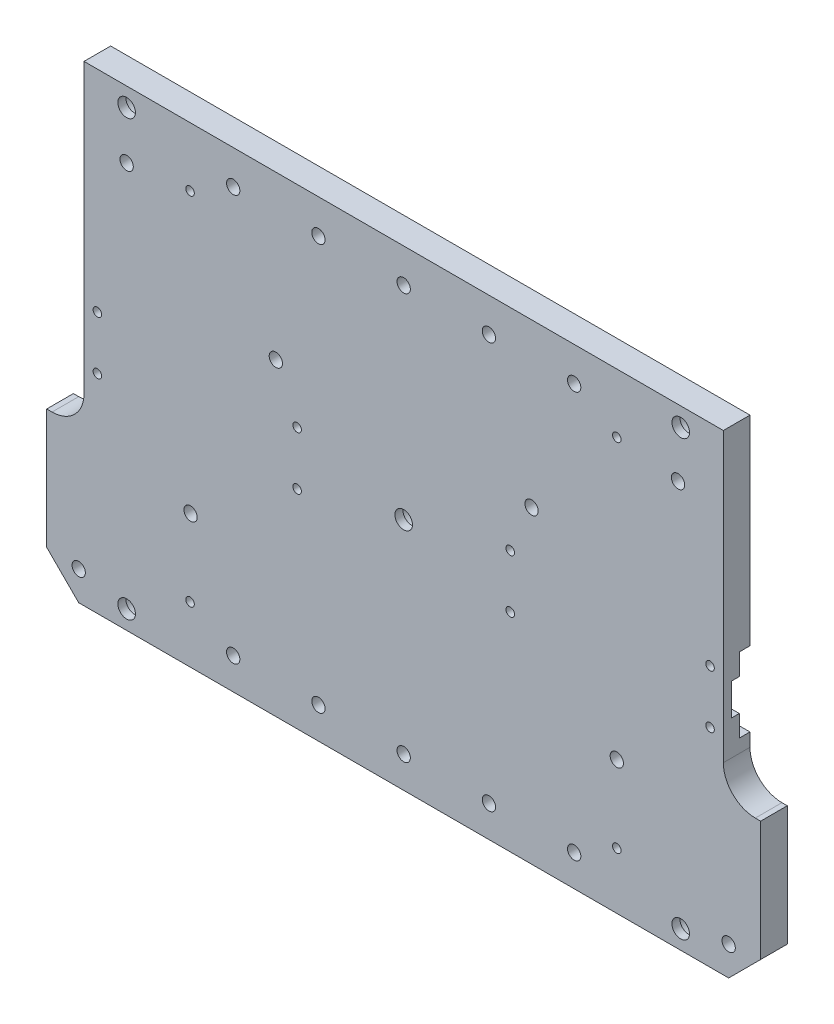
from build123d import *

# Parameters (mm, degrees)
SKETCH_1_W            = 134
SKETCH_1_H            = 88.5
EXTRUDE_1_DEPTH       = 5
HOLE_WIZARD_M31_D     = 2.5
HOLE_WIZARD_M31_DEPTH = 8.5
HOLE_WIZARD_M31_TIP   = 0.751075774
HOLE_WIZARD_M41_D     = 3.3
HOLE_WIZARD_M21_D     = 1.6
CHAMFER_1_SIZE        = 6
CUT_EXTRUDE_2_DEPTH   = 3.5
SKETCH_8_W            = 20
SKETCH_8_H            = 60
CUT_EXTRUDE_3_DEPTH   = 161.665024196
FILLET_1_R            = 6
HOLE_WIZARD_M32_D     = 2.5
SKETCH_11_W           = 42.5
SKETCH_11_H           = 14
CUT_EXTRUDE_4_DEPTH   = 1
CUT_EXTRUDE_6_DEPTH   = 2
HOLE_WIZARD_M22_D     = 1.6
SKETCH_16_R           = 2.5
CUT_EXTRUDE_7_DEPTH   = 3.5


with BuildPart() as part:
    # Sketch 1 → Extrude 1 (new body)
    with BuildSketch(Plane.XY):
        with Locations((67, 44.25)):
            Rectangle(SKETCH_1_W, SKETCH_1_H)
    extrude(amount=EXTRUDE_1_DEPTH)

    # Hole Wizard M31
    with Locations(Plane(origin=(35, 82.1, 5), x_dir=(1, 0, 0), z_dir=(0, 0, 1))):
        with Locations((0, 0), (16, 0), (32, 0), (48, 0), (64, 0), (0, -76.2), (16, -76.2), (32, -76.2), (48, -76.2), (64, -76.2)):
            Hole(HOLE_WIZARD_M31_D / 2, depth=HOLE_WIZARD_M31_DEPTH)
            with Locations((0, 0, -(HOLE_WIZARD_M31_DEPTH + HOLE_WIZARD_M31_TIP / 2))):  # 118° drill point
                Cone(0, HOLE_WIZARD_M31_D / 2, HOLE_WIZARD_M31_TIP, mode=Mode.SUBTRACT)

    # Hole Wizard M41 (through all)
    with Locations(Plane(origin=(15, 85, 5), x_dir=(1, 0, 0), z_dir=(0, 0, 1))):
        with Locations((0, 0), (104, 0), (52, -41), (0, -81.5), (104, -81.5)):
            Hole(HOLE_WIZARD_M41_D / 2)

    # Hole Wizard M21 (through all)
    with Locations(Plane(origin=(107, 77.4, 5), x_dir=(1, 0, 0), z_dir=(0, 0, 1))):
        with Locations((0, 0), (-80.1, 0), (-80.1, -66.8), (0, -66.8)):
            Hole(HOLE_WIZARD_M21_D / 2)

    # Chamfer 1
    chamfer_1_edges = [part.edges().sort_by_distance(p)[0] for p in [
        (0, 88.5, 2.5),
        (134, 88.5, 2.5),
        (134, 0, 2.5),
        (0, 0, 2.5),
    ]]
    chamfer(chamfer_1_edges, length=CHAMFER_1_SIZE)

    # Sketch 7 → Cut-Extrude 2 (cut)
    with BuildSketch(Plane(origin=(0, 0, 0), x_dir=(-1, 0, 0), z_dir=(0, 0, -1))):
        with BuildLine():
            Line((2, 47), (2, 41))
            Line((2, 41), (-39, 41))
            ThreePointArc((-39, 41), (-40.060660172, 41.439339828), (-40.5, 42.5))
            Line((-40.5, 42.5), (-43, 42.5))
            ThreePointArc((-43, 42.5), (-44.5, 44), (-43, 45.5))
            Line((-43, 45.5), (-40.5, 45.5))
            ThreePointArc((-40.5, 45.5), (-40.060660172, 46.560660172), (-39, 47))
            Line((-39, 47), (2, 47))
        make_face()
        with BuildLine():
            Line((-136, 41), (-95, 41))
            ThreePointArc((-95, 41), (-93.939339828, 41.439339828), (-93.5, 42.5))
            Line((-93.5, 42.5), (-91, 42.5))
            ThreePointArc((-91, 42.5), (-89.5, 44), (-91, 45.5))
            Line((-91, 45.5), (-93.5, 45.5))
            ThreePointArc((-93.5, 45.5), (-93.939339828, 46.560660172), (-95, 47))
            Line((-95, 47), (-136, 47))
            Line((-136, 47), (-136, 41))
        make_face()
    extrude(amount=-CUT_EXTRUDE_2_DEPTH, mode=Mode.SUBTRACT)

    # Sketch 8 → Cut-Extrude 3 (cut, through all)
    with BuildSketch(Plane(origin=(0, 0, 0), x_dir=(-1, 0, 0), z_dir=(0, 0, -1))):
        with Locations((3, 58.5)):
            Rectangle(SKETCH_8_W, SKETCH_8_H)
        with Locations((-137, 58.5)):
            Rectangle(SKETCH_8_W, SKETCH_8_H)
    extrude(amount=-CUT_EXTRUDE_3_DEPTH, mode=Mode.SUBTRACT)

    # Fillet 1
    fillet_1_edges = [part.edges().sort_by_distance(p)[0] for p in [
        (7, 28.5, 2.5),
        (127, 28.5, 2.5),
    ]]
    fillet(fillet_1_edges, radius=FILLET_1_R)

    # Hole Wizard M32 (through all)
    with Locations(Plane(origin=(118.5, 76, 0), x_dir=(-1, 0, 0), z_dir=(0, 0, -1))):
        with Locations((0, 0), (27.5, -18), (75.5, -18), (91.5, -51), (112.5, -70.5), (-9.5, -70.5), (11.5, -51), (103.5, 0)):
            Hole(HOLE_WIZARD_M32_D / 2)

    # Sketch 11 → Cut-Extrude 4 (cut)
    with BuildSketch(Plane(origin=(0, 0, 0), x_dir=(-1, 0, 0), z_dir=(0, 0, -1))):
        with Locations((-28.25, 44)):
            Rectangle(SKETCH_11_W, SKETCH_11_H)
    cut_extrude_4 = extrude(amount=-CUT_EXTRUDE_4_DEPTH, mode=Mode.SUBTRACT)

    # Sketch 13 → Cut-Extrude 6 (cut)
    with BuildSketch(Plane(origin=(0, 0, 0), x_dir=(-1, 0, 0), z_dir=(0, 0, -1))):
        with BuildLine():
            Line((-49.5, 51), (-44.5, 51))
            ThreePointArc((-44.5, 51), (-42.5, 49), (-44.5, 47))
            Line((-44.5, 47), (-49.5, 47))
            ThreePointArc((-49.5, 47), (-51.5, 49), (-49.5, 51))
        make_face()
        with BuildLine():
            Line((-49.5, 41), (-44.5, 41))
            ThreePointArc((-44.5, 41), (-42.5, 39), (-44.5, 37))
            Line((-44.5, 37), (-49.5, 37))
            ThreePointArc((-49.5, 37), (-51.5, 39), (-49.5, 41))
        make_face()
        with BuildLine():
            Line((-12, 51), (-7, 51))
            Line((-7, 51), (-7, 46.5))
            Line((-7, 46.5), (-14, 46.5))
            Line((-14, 46.5), (-14, 49))
            ThreePointArc((-14, 49), (-13.414213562, 50.414213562), (-12, 51))
        make_face()
        with BuildLine():
            Line((-14, 42), (-7, 42))
            Line((-7, 42), (-7, 37))
            Line((-7, 37), (-12, 37))
            ThreePointArc((-12, 37), (-13.414213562, 37.585786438), (-14, 39))
            Line((-14, 39), (-14, 42))
        make_face()
    cut_extrude_6 = extrude(amount=-CUT_EXTRUDE_6_DEPTH, mode=Mode.SUBTRACT)

    # Mirror 1: Cut-Extrude 4, Cut-Extrude 6 across plane
    add(cut_extrude_4.mirror(Plane.ZY.offset(-67)), mode=Mode.SUBTRACT)
    add(cut_extrude_6.mirror(Plane.ZY.offset(-67)), mode=Mode.SUBTRACT)

    # Hole Wizard M22 (through all)
    with Locations(Plane(origin=(47, 49, 2), x_dir=(-1, 0, 0), z_dir=(0, 0, -1))):
        with Locations((0, 0), (0, -10), (37.5, -10), (37.5, 0)):
            hole_wizard_m22 = Hole(HOLE_WIZARD_M22_D / 2)

    # Mirror 2: Hole Wizard M22 across plane
    add(hole_wizard_m22.mirror(Plane.ZY.offset(-67)), mode=Mode.SUBTRACT)

    # Sketch 16 → Cut-Extrude 7 (cut)
    with BuildSketch(Plane(origin=(0, 0, 0), x_dir=(-1, 0, 0), z_dir=(0, 0, -1))):
        with Locations((-15, 85)):
            Circle(SKETCH_16_R)
        with Locations((-119, 85)):
            Circle(SKETCH_16_R)
        with Locations((-119, 3.5)):
            Circle(SKETCH_16_R)
        with Locations((-15, 3.5)):
            Circle(SKETCH_16_R)
        with Locations((-67, 44)):
            Circle(SKETCH_16_R)
    extrude(amount=-CUT_EXTRUDE_7_DEPTH, mode=Mode.SUBTRACT)


solid = part.part
